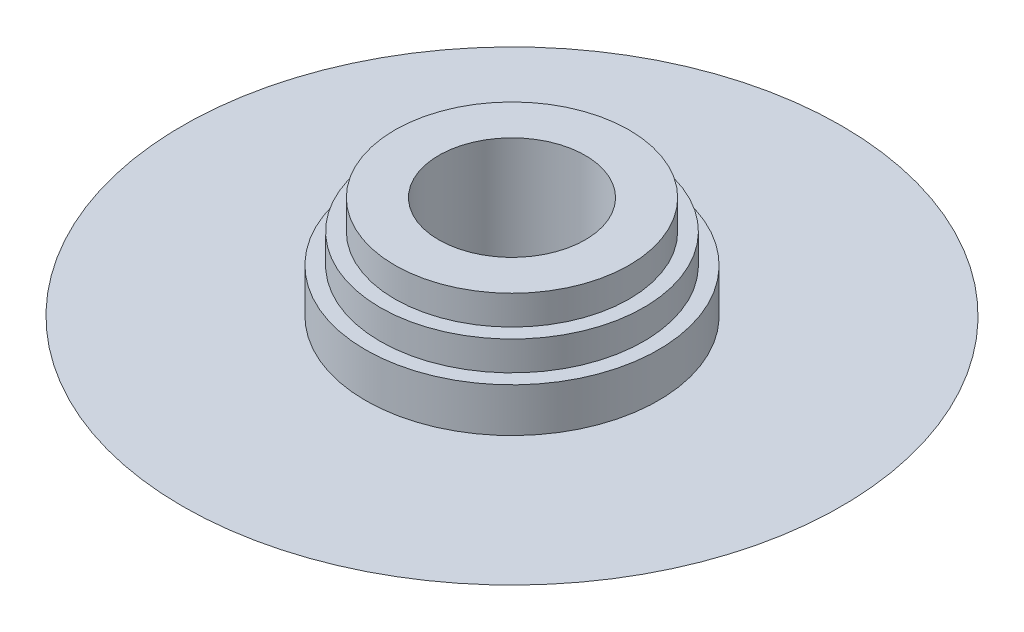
ISO-10303-21;
HEADER;
FILE_DESCRIPTION(('STEP AP214'),'2;1');
FILE_NAME('part.step','',(''),(''),'','','');
FILE_SCHEMA(('AUTOMOTIVE_DESIGN { 1 0 10303 214 1 1 1 1 }'));
ENDSEC;
DATA;
#1=APPLICATION_CONTEXT('core data for automotive mechanical design processes');
#2=APPLICATION_PROTOCOL_DEFINITION('international standard','automotive_design',2000,#1);
#3=PRODUCT_CONTEXT('',#1,'mechanical');
#4=PRODUCT('Part','Part','',(#3));
#5=PRODUCT_RELATED_PRODUCT_CATEGORY('part','',(#4));
#6=PRODUCT_DEFINITION_FORMATION('','',#4);
#7=PRODUCT_DEFINITION_CONTEXT('part definition',#1,'design');
#8=PRODUCT_DEFINITION('design','',#6,#7);
#9=PRODUCT_DEFINITION_SHAPE('','',#8);
#10=(LENGTH_UNIT() NAMED_UNIT(*) SI_UNIT(.MILLI.,.METRE.));
#11=(NAMED_UNIT(*) PLANE_ANGLE_UNIT() SI_UNIT($,.RADIAN.));
#12=(NAMED_UNIT(*) SI_UNIT($,.STERADIAN.) SOLID_ANGLE_UNIT());
#13=UNCERTAINTY_MEASURE_WITH_UNIT(LENGTH_MEASURE(1.E-05),#10,'distance_accuracy_value','');
#14=(GEOMETRIC_REPRESENTATION_CONTEXT(3) GLOBAL_UNCERTAINTY_ASSIGNED_CONTEXT((#13)) GLOBAL_UNIT_ASSIGNED_CONTEXT((#10,
#11,#12)) REPRESENTATION_CONTEXT('',''));
#15=CARTESIAN_POINT('',(0.,0.,0.));
#16=DIRECTION('',(0.,0.,1.));
#17=DIRECTION('',(1.,0.,0.));
#18=AXIS2_PLACEMENT_3D('',#15,#16,#17);
#19=CARTESIAN_POINT('',(0.,4.5,0.));
#20=DIRECTION('',(0.,1.,0.));
#21=DIRECTION('',(0.,0.,1.));
#22=AXIS2_PLACEMENT_3D('',#19,#20,#21);
#23=PLANE('',#22);
#24=CARTESIAN_POINT('',(0.,4.5,0.));
#25=DIRECTION('',(0.,1.,0.));
#26=DIRECTION('',(0.,0.,1.));
#27=AXIS2_PLACEMENT_3D('',#24,#25,#26);
#28=CIRCLE('',#27,13.5);
#29=CARTESIAN_POINT('',(0.,4.5,13.5));
#30=VERTEX_POINT('',#29);
#31=EDGE_CURVE('E40',#30,#30,#28,.T.);
#32=ORIENTED_EDGE('',*,*,#31,.F.);
#33=EDGE_LOOP('',(#32));
#34=FACE_BOUND('',#33,.T.);
#35=CARTESIAN_POINT('',(0.,4.5,0.));
#36=DIRECTION('',(0.,1.,0.));
#37=DIRECTION('',(0.,0.,1.));
#38=AXIS2_PLACEMENT_3D('',#35,#36,#37);
#39=CIRCLE('',#38,5.);
#40=CARTESIAN_POINT('',(0.,4.5,5.));
#41=VERTEX_POINT('',#40);
#42=EDGE_CURVE('E64',#41,#41,#39,.T.);
#43=ORIENTED_EDGE('',*,*,#42,.T.);
#44=EDGE_LOOP('',(#43));
#45=FACE_BOUND('',#44,.T.);
#46=ADVANCED_FACE('F29',(#34,#45),#23,.F.);
#47=CARTESIAN_POINT('',(0.,14.5,0.));
#48=DIRECTION('',(0.,1.,0.));
#49=DIRECTION('',(0.,0.,1.));
#50=AXIS2_PLACEMENT_3D('',#47,#48,#49);
#51=PLANE('',#50);
#52=CARTESIAN_POINT('',(0.,14.5,0.));
#53=DIRECTION('',(0.,1.,0.));
#54=DIRECTION('',(0.,0.,1.));
#55=AXIS2_PLACEMENT_3D('',#52,#53,#54);
#56=CIRCLE('',#55,8.);
#57=CARTESIAN_POINT('',(0.,14.5,8.));
#58=VERTEX_POINT('',#57);
#59=EDGE_CURVE('E55',#58,#58,#56,.T.);
#60=ORIENTED_EDGE('',*,*,#59,.T.);
#61=EDGE_LOOP('',(#60));
#62=FACE_BOUND('',#61,.T.);
#63=CARTESIAN_POINT('',(0.,14.5,0.));
#64=DIRECTION('',(0.,1.,0.));
#65=DIRECTION('',(0.,0.,1.));
#66=AXIS2_PLACEMENT_3D('',#63,#64,#65);
#67=CIRCLE('',#66,5.);
#68=CARTESIAN_POINT('',(0.,14.5,5.));
#69=VERTEX_POINT('',#68);
#70=EDGE_CURVE('E61',#69,#69,#67,.T.);
#71=ORIENTED_EDGE('',*,*,#70,.F.);
#72=EDGE_LOOP('',(#71));
#73=FACE_BOUND('',#72,.T.);
#74=ADVANCED_FACE('F82',(#62,#73),#51,.T.);
#75=CARTESIAN_POINT('',(0.,12.5,0.));
#76=DIRECTION('',(0.,1.,0.));
#77=DIRECTION('',(0.,0.,1.));
#78=AXIS2_PLACEMENT_3D('',#75,#76,#77);
#79=PLANE('',#78);
#80=CARTESIAN_POINT('',(0.,12.5,0.));
#81=DIRECTION('',(0.,1.,0.));
#82=DIRECTION('',(0.,0.,1.));
#83=AXIS2_PLACEMENT_3D('',#80,#81,#82);
#84=CIRCLE('',#83,9.);
#85=CARTESIAN_POINT('',(0.,12.5,9.));
#86=VERTEX_POINT('',#85);
#87=EDGE_CURVE('E49',#86,#86,#84,.T.);
#88=ORIENTED_EDGE('',*,*,#87,.T.);
#89=EDGE_LOOP('',(#88));
#90=FACE_BOUND('',#89,.T.);
#91=CARTESIAN_POINT('',(0.,12.5,0.));
#92=DIRECTION('',(0.,1.,0.));
#93=DIRECTION('',(0.,0.,1.));
#94=AXIS2_PLACEMENT_3D('',#91,#92,#93);
#95=CIRCLE('',#94,8.);
#96=CARTESIAN_POINT('',(0.,12.5,8.));
#97=VERTEX_POINT('',#96);
#98=EDGE_CURVE('E58',#97,#97,#95,.T.);
#99=ORIENTED_EDGE('',*,*,#98,.F.);
#100=EDGE_LOOP('',(#99));
#101=FACE_BOUND('',#100,.T.);
#102=ADVANCED_FACE('F88',(#90,#101),#79,.T.);
#103=CARTESIAN_POINT('',(0.,10.5,0.));
#104=DIRECTION('',(0.,1.,0.));
#105=DIRECTION('',(0.,0.,1.));
#106=AXIS2_PLACEMENT_3D('',#103,#104,#105);
#107=PLANE('',#106);
#108=CARTESIAN_POINT('',(0.,10.5,0.));
#109=DIRECTION('',(0.,1.,0.));
#110=DIRECTION('',(0.,0.,1.));
#111=AXIS2_PLACEMENT_3D('',#108,#109,#110);
#112=CIRCLE('',#111,10.);
#113=CARTESIAN_POINT('',(0.,10.5,10.));
#114=VERTEX_POINT('',#113);
#115=EDGE_CURVE('E44',#114,#114,#112,.T.);
#116=ORIENTED_EDGE('',*,*,#115,.T.);
#117=EDGE_LOOP('',(#116));
#118=FACE_BOUND('',#117,.T.);
#119=CARTESIAN_POINT('',(0.,10.5,0.));
#120=DIRECTION('',(0.,1.,0.));
#121=DIRECTION('',(0.,0.,1.));
#122=AXIS2_PLACEMENT_3D('',#119,#120,#121);
#123=CIRCLE('',#122,9.);
#124=CARTESIAN_POINT('',(0.,10.5,9.));
#125=VERTEX_POINT('',#124);
#126=EDGE_CURVE('E52',#125,#125,#123,.T.);
#127=ORIENTED_EDGE('',*,*,#126,.F.);
#128=EDGE_LOOP('',(#127));
#129=FACE_BOUND('',#128,.T.);
#130=ADVANCED_FACE('F102',(#118,#129),#107,.T.);
#131=CARTESIAN_POINT('',(-22.5,7.5,0.));
#132=DIRECTION('',(0.,-1.,0.));
#133=DIRECTION('',(0.,0.,-1.));
#134=AXIS2_PLACEMENT_3D('',#131,#132,#133);
#135=PLANE('',#134);
#136=CARTESIAN_POINT('',(0.,7.5,0.));
#137=DIRECTION('',(0.,-1.,0.));
#138=DIRECTION('',(0.,0.,-1.));
#139=AXIS2_PLACEMENT_3D('',#136,#137,#138);
#140=CIRCLE('',#139,22.5);
#141=CARTESIAN_POINT('',(0.,7.5,-22.5));
#142=VERTEX_POINT('',#141);
#143=EDGE_CURVE('E36',#142,#142,#140,.T.);
#144=ORIENTED_EDGE('',*,*,#143,.F.);
#145=EDGE_LOOP('',(#144));
#146=FACE_BOUND('',#145,.T.);
#147=CARTESIAN_POINT('',(0.,7.5,0.));
#148=DIRECTION('',(0.,-1.,0.));
#149=DIRECTION('',(0.,0.,-1.));
#150=AXIS2_PLACEMENT_3D('',#147,#148,#149);
#151=CIRCLE('',#150,10.);
#152=CARTESIAN_POINT('',(0.,7.5,-10.));
#153=VERTEX_POINT('',#152);
#154=EDGE_CURVE('E10',#153,#153,#151,.F.);
#155=ORIENTED_EDGE('',*,*,#154,.F.);
#156=EDGE_LOOP('',(#155));
#157=FACE_BOUND('',#156,.T.);
#158=ADVANCED_FACE('F31',(#146,#157),#135,.F.);
#159=CARTESIAN_POINT('',(0.,7.5,0.));
#160=DIRECTION('',(0.,1.,0.));
#161=DIRECTION('',(0.,0.,1.));
#162=AXIS2_PLACEMENT_3D('',#159,#160,#161);
#163=CONICAL_SURFACE('',#162,22.5,1.24904577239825);
#164=ORIENTED_EDGE('',*,*,#31,.T.);
#165=EDGE_LOOP('',(#164));
#166=FACE_BOUND('',#165,.T.);
#167=ORIENTED_EDGE('',*,*,#143,.T.);
#168=EDGE_LOOP('',(#167));
#169=FACE_BOUND('',#168,.T.);
#170=ADVANCED_FACE('F94',(#166,#169),#163,.T.);
#171=CARTESIAN_POINT('',(0.,10.5,0.));
#172=DIRECTION('',(0.,-1.,0.));
#173=DIRECTION('',(0.,0.,-1.));
#174=AXIS2_PLACEMENT_3D('',#171,#172,#173);
#175=CYLINDRICAL_SURFACE('',#174,10.);
#176=ORIENTED_EDGE('',*,*,#115,.F.);
#177=EDGE_LOOP('',(#176));
#178=FACE_BOUND('',#177,.T.);
#179=ORIENTED_EDGE('',*,*,#154,.T.);
#180=EDGE_LOOP('',(#179));
#181=FACE_BOUND('',#180,.T.);
#182=ADVANCED_FACE('F92',(#178,#181),#175,.T.);
#183=CARTESIAN_POINT('',(0.,12.5,0.));
#184=DIRECTION('',(0.,-1.,0.));
#185=DIRECTION('',(0.,0.,-1.));
#186=AXIS2_PLACEMENT_3D('',#183,#184,#185);
#187=CYLINDRICAL_SURFACE('',#186,9.);
#188=ORIENTED_EDGE('',*,*,#87,.F.);
#189=EDGE_LOOP('',(#188));
#190=FACE_BOUND('',#189,.T.);
#191=ORIENTED_EDGE('',*,*,#126,.T.);
#192=EDGE_LOOP('',(#191));
#193=FACE_BOUND('',#192,.T.);
#194=ADVANCED_FACE('F77',(#190,#193),#187,.T.);
#195=CARTESIAN_POINT('',(0.,14.5,0.));
#196=DIRECTION('',(0.,-1.,0.));
#197=DIRECTION('',(0.,0.,-1.));
#198=AXIS2_PLACEMENT_3D('',#195,#196,#197);
#199=CYLINDRICAL_SURFACE('',#198,8.);
#200=ORIENTED_EDGE('',*,*,#59,.F.);
#201=EDGE_LOOP('',(#200));
#202=FACE_BOUND('',#201,.T.);
#203=ORIENTED_EDGE('',*,*,#98,.T.);
#204=EDGE_LOOP('',(#203));
#205=FACE_BOUND('',#204,.T.);
#206=ADVANCED_FACE('F71',(#202,#205),#199,.T.);
#207=CARTESIAN_POINT('',(0.,14.5,0.));
#208=DIRECTION('',(0.,-1.,0.));
#209=DIRECTION('',(0.,0.,-1.));
#210=AXIS2_PLACEMENT_3D('',#207,#208,#209);
#211=CYLINDRICAL_SURFACE('',#210,5.);
#212=ORIENTED_EDGE('',*,*,#70,.T.);
#213=EDGE_LOOP('',(#212));
#214=FACE_BOUND('',#213,.T.);
#215=ORIENTED_EDGE('',*,*,#42,.F.);
#216=EDGE_LOOP('',(#215));
#217=FACE_BOUND('',#216,.T.);
#218=ADVANCED_FACE('F69',(#214,#217),#211,.F.);
#219=CLOSED_SHELL('',(#46,#74,#102,#130,#158,#170,#182,#194,#206,#218));
#220=MANIFOLD_SOLID_BREP('B2',#219);
#221=ADVANCED_BREP_SHAPE_REPRESENTATION('',(#18,#220),#14);
#222=SHAPE_DEFINITION_REPRESENTATION(#9,#221);
ENDSEC;
END-ISO-10303-21;
